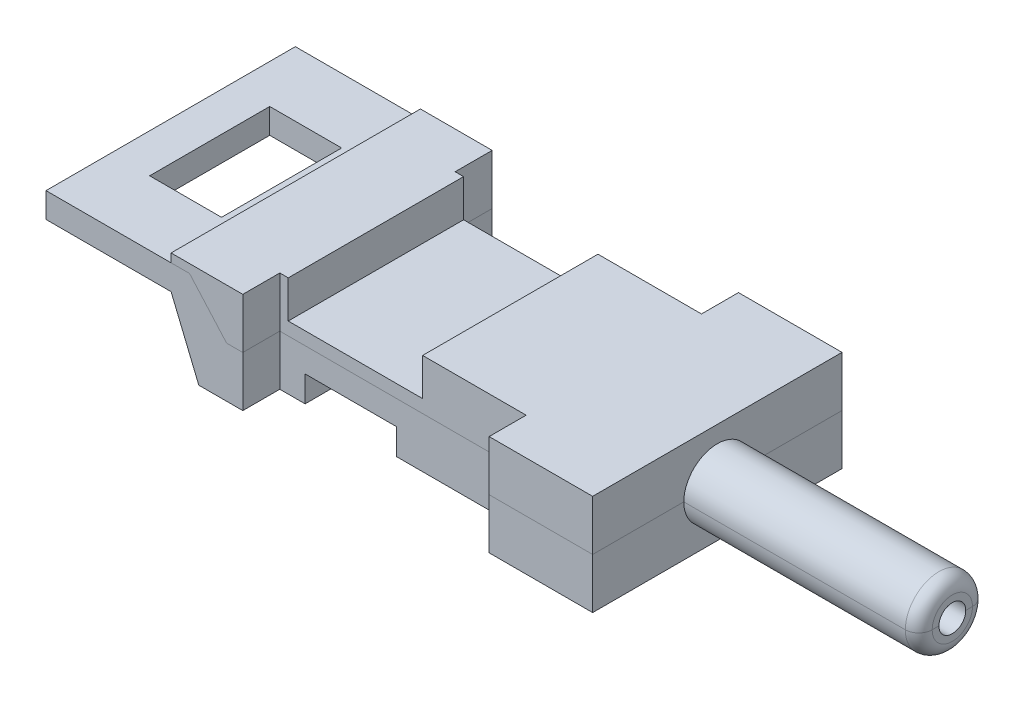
ISO-10303-21;
HEADER;
FILE_DESCRIPTION(('STEP AP214'),'2;1');
FILE_NAME('part.step','',(''),(''),'','','');
FILE_SCHEMA(('AUTOMOTIVE_DESIGN { 1 0 10303 214 1 1 1 1 }'));
ENDSEC;
DATA;
#1=APPLICATION_CONTEXT('core data for automotive mechanical design processes');
#2=APPLICATION_PROTOCOL_DEFINITION('international standard','automotive_design',2000,#1);
#3=PRODUCT_CONTEXT('',#1,'mechanical');
#4=PRODUCT('Part','Part','',(#3));
#5=PRODUCT_RELATED_PRODUCT_CATEGORY('part','',(#4));
#6=PRODUCT_DEFINITION_FORMATION('','',#4);
#7=PRODUCT_DEFINITION_CONTEXT('part definition',#1,'design');
#8=PRODUCT_DEFINITION('design','',#6,#7);
#9=PRODUCT_DEFINITION_SHAPE('','',#8);
#10=(LENGTH_UNIT() NAMED_UNIT(*) SI_UNIT(.MILLI.,.METRE.));
#11=(NAMED_UNIT(*) PLANE_ANGLE_UNIT() SI_UNIT($,.RADIAN.));
#12=(NAMED_UNIT(*) SI_UNIT($,.STERADIAN.) SOLID_ANGLE_UNIT());
#13=UNCERTAINTY_MEASURE_WITH_UNIT(LENGTH_MEASURE(1.E-05),#10,'distance_accuracy_value','');
#14=(GEOMETRIC_REPRESENTATION_CONTEXT(3) GLOBAL_UNCERTAINTY_ASSIGNED_CONTEXT((#13)) GLOBAL_UNIT_ASSIGNED_CONTEXT((#10,
#11,#12)) REPRESENTATION_CONTEXT('',''));
#15=CARTESIAN_POINT('',(0.,0.,0.));
#16=DIRECTION('',(0.,0.,1.));
#17=DIRECTION('',(1.,0.,0.));
#18=AXIS2_PLACEMENT_3D('',#15,#16,#17);
#19=CARTESIAN_POINT('',(25.2903479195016,-10.001,-18.5695273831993));
#20=DIRECTION('',(1.,0.,0.));
#21=DIRECTION('',(0.,0.,-1.));
#22=AXIS2_PLACEMENT_3D('',#19,#20,#21);
#23=PLANE('',#22);
#24=DIRECTION('',(0.,0.,-1.));
#25=VECTOR('',#24,1.);
#26=CARTESIAN_POINT('',(25.2903479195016,-2.5,-18.5695273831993));
#27=LINE('',#26,#25);
#28=CARTESIAN_POINT('',(25.2903479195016,-2.5,-13.0580043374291));
#29=VERTEX_POINT('',#28);
#30=CARTESIAN_POINT('',(25.2903479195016,-2.5,-18.5695273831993));
#31=VERTEX_POINT('',#30);
#32=EDGE_CURVE('E11',#29,#31,#27,.T.);
#33=ORIENTED_EDGE('',*,*,#32,.F.);
#34=DIRECTION('',(0.,1.,0.));
#35=VECTOR('',#34,1.);
#36=CARTESIAN_POINT('',(25.2903479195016,-10.001,-13.0580043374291));
#37=LINE('',#36,#35);
#38=CARTESIAN_POINT('',(25.2903479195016,5.,-13.0580043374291));
#39=VERTEX_POINT('',#38);
#40=EDGE_CURVE('E429',#29,#39,#37,.T.);
#41=ORIENTED_EDGE('',*,*,#40,.T.);
#42=DIRECTION('',(0.,0.,-1.));
#43=VECTOR('',#42,1.);
#44=CARTESIAN_POINT('',(25.2903479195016,5.,-18.5695273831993));
#45=LINE('',#44,#43);
#46=CARTESIAN_POINT('',(25.2903479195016,5.,-18.5695273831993));
#47=VERTEX_POINT('',#46);
#48=EDGE_CURVE('E627',#39,#47,#45,.T.);
#49=ORIENTED_EDGE('',*,*,#48,.T.);
#50=DIRECTION('',(0.,1.,0.));
#51=VECTOR('',#50,1.);
#52=CARTESIAN_POINT('',(25.2903479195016,-10.001,-18.5695273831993));
#53=LINE('',#52,#51);
#54=EDGE_CURVE('E629',#31,#47,#53,.T.);
#55=ORIENTED_EDGE('',*,*,#54,.F.);
#56=EDGE_LOOP('',(#33,#41,#49,#55));
#57=FACE_BOUND('',#56,.T.);
#58=ADVANCED_FACE('F33',(#57),#23,.F.);
#59=CARTESIAN_POINT('',(-11.3977082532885,-10.001,-13.058004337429));
#60=DIRECTION('',(-1.,0.,0.));
#61=DIRECTION('',(0.,0.,1.));
#62=AXIS2_PLACEMENT_3D('',#59,#60,#61);
#63=PLANE('',#62);
#64=DIRECTION('',(0.,0.,1.));
#65=VECTOR('',#64,1.);
#66=CARTESIAN_POINT('',(-11.3977082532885,-2.5,-13.058004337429));
#67=LINE('',#66,#65);
#68=CARTESIAN_POINT('',(-11.3977082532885,-2.5,-18.5695273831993));
#69=VERTEX_POINT('',#68);
#70=CARTESIAN_POINT('',(-11.3977082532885,-2.5,-13.058004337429));
#71=VERTEX_POINT('',#70);
#72=EDGE_CURVE('E43',#69,#71,#67,.T.);
#73=ORIENTED_EDGE('',*,*,#72,.F.);
#74=DIRECTION('',(0.,1.,0.));
#75=VECTOR('',#74,1.);
#76=CARTESIAN_POINT('',(-11.3977082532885,-10.001,-18.5695273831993));
#77=LINE('',#76,#75);
#78=CARTESIAN_POINT('',(-11.3977082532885,5.,-18.5695273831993));
#79=VERTEX_POINT('',#78);
#80=EDGE_CURVE('E446',#69,#79,#77,.T.);
#81=ORIENTED_EDGE('',*,*,#80,.T.);
#82=DIRECTION('',(0.,0.,1.));
#83=VECTOR('',#82,1.);
#84=CARTESIAN_POINT('',(-11.3977082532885,5.,-13.058004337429));
#85=LINE('',#84,#83);
#86=CARTESIAN_POINT('',(-11.3977082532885,5.,-13.058004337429));
#87=VERTEX_POINT('',#86);
#88=EDGE_CURVE('E434',#79,#87,#85,.T.);
#89=ORIENTED_EDGE('',*,*,#88,.T.);
#90=DIRECTION('',(0.,1.,0.));
#91=VECTOR('',#90,1.);
#92=CARTESIAN_POINT('',(-11.3977082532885,-10.001,-13.058004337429));
#93=LINE('',#92,#91);
#94=EDGE_CURVE('E426',#71,#87,#93,.T.);
#95=ORIENTED_EDGE('',*,*,#94,.F.);
#96=EDGE_LOOP('',(#73,#81,#89,#95));
#97=FACE_BOUND('',#96,.T.);
#98=ADVANCED_FACE('F432',(#97),#63,.F.);
#99=CARTESIAN_POINT('',(-40.7086650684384,5.,18.5695273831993));
#100=DIRECTION('',(0.,0.,-1.));
#101=DIRECTION('',(-1.,0.,0.));
#102=AXIS2_PLACEMENT_3D('',#99,#100,#101);
#103=PLANE('',#102);
#104=DIRECTION('',(-1.,0.,0.));
#105=VECTOR('',#104,1.);
#106=CARTESIAN_POINT('',(-40.7086650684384,3.7238100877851,18.5695273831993));
#107=LINE('',#106,#105);
#108=CARTESIAN_POINT('',(-19.3295566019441,3.7238100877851,18.5695273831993));
#109=VERTEX_POINT('',#108);
#110=CARTESIAN_POINT('',(-22.0774506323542,3.7238100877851,18.5695273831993));
#111=VERTEX_POINT('',#110);
#112=EDGE_CURVE('E51',#109,#111,#107,.T.);
#113=ORIENTED_EDGE('',*,*,#112,.F.);
#114=DIRECTION('',(-0.663405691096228,0.748259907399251,0.));
#115=VECTOR('',#114,1.);
#116=CARTESIAN_POINT('',(-29.372154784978,15.0509266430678,18.5695273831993));
#117=LINE('',#116,#115);
#118=CARTESIAN_POINT('',(-13.811539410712,-2.5,18.5695273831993));
#119=VERTEX_POINT('',#118);
#120=EDGE_CURVE('E55',#119,#109,#117,.T.);
#121=ORIENTED_EDGE('',*,*,#120,.F.);
#122=DIRECTION('',(-1.,0.,0.));
#123=VECTOR('',#122,1.);
#124=CARTESIAN_POINT('',(-40.7086650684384,-2.5,18.5695273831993));
#125=LINE('',#124,#123);
#126=CARTESIAN_POINT('',(-11.3977082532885,-2.5,18.5695273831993));
#127=VERTEX_POINT('',#126);
#128=EDGE_CURVE('E369',#127,#119,#125,.T.);
#129=ORIENTED_EDGE('',*,*,#128,.F.);
#130=DIRECTION('',(0.,1.,0.));
#131=VECTOR('',#130,1.);
#132=CARTESIAN_POINT('',(-11.3977082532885,-10.001,18.5695273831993));
#133=LINE('',#132,#131);
#134=CARTESIAN_POINT('',(-11.3977082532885,5.,18.5695273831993));
#135=VERTEX_POINT('',#134);
#136=EDGE_CURVE('E487',#127,#135,#133,.T.);
#137=ORIENTED_EDGE('',*,*,#136,.T.);
#138=DIRECTION('',(1.,0.,0.));
#139=VECTOR('',#138,1.);
#140=CARTESIAN_POINT('',(-40.7086650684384,5.,18.5695273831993));
#141=LINE('',#140,#139);
#142=CARTESIAN_POINT('',(-22.0774506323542,5.,18.5695273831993));
#143=VERTEX_POINT('',#142);
#144=EDGE_CURVE('E581',#143,#135,#141,.T.);
#145=ORIENTED_EDGE('',*,*,#144,.F.);
#146=DIRECTION('',(0.,1.,0.));
#147=VECTOR('',#146,1.);
#148=CARTESIAN_POINT('',(-22.0774506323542,3.7238100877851,18.5695273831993));
#149=LINE('',#148,#147);
#150=EDGE_CURVE('E744',#111,#143,#149,.T.);
#151=ORIENTED_EDGE('',*,*,#150,.F.);
#152=EDGE_LOOP('',(#113,#121,#129,#137,#145,#151));
#153=FACE_BOUND('',#152,.T.);
#154=ADVANCED_FACE('F750',(#153),#103,.F.);
#155=CARTESIAN_POINT('',(-11.3977082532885,-10.001,13.058004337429));
#156=DIRECTION('',(-1.,0.,0.));
#157=DIRECTION('',(0.,0.,1.));
#158=AXIS2_PLACEMENT_3D('',#155,#156,#157);
#159=PLANE('',#158);
#160=DIRECTION('',(0.,0.,1.));
#161=VECTOR('',#160,1.);
#162=CARTESIAN_POINT('',(-11.3977082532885,-2.5,13.058004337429));
#163=LINE('',#162,#161);
#164=CARTESIAN_POINT('',(-11.3977082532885,-2.5,13.058004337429));
#165=VERTEX_POINT('',#164);
#166=EDGE_CURVE('E374',#165,#127,#163,.T.);
#167=ORIENTED_EDGE('',*,*,#166,.F.);
#168=DIRECTION('',(0.,1.,0.));
#169=VECTOR('',#168,1.);
#170=CARTESIAN_POINT('',(-11.3977082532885,-10.001,13.058004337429));
#171=LINE('',#170,#169);
#172=CARTESIAN_POINT('',(-11.3977082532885,5.,13.058004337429));
#173=VERTEX_POINT('',#172);
#174=EDGE_CURVE('E491',#165,#173,#171,.T.);
#175=ORIENTED_EDGE('',*,*,#174,.T.);
#176=DIRECTION('',(0.,0.,1.));
#177=VECTOR('',#176,1.);
#178=CARTESIAN_POINT('',(-11.3977082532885,5.,13.058004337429));
#179=LINE('',#178,#177);
#180=EDGE_CURVE('E479',#173,#135,#179,.T.);
#181=ORIENTED_EDGE('',*,*,#180,.T.);
#182=ORIENTED_EDGE('',*,*,#136,.F.);
#183=EDGE_LOOP('',(#167,#175,#181,#182));
#184=FACE_BOUND('',#183,.T.);
#185=ADVANCED_FACE('F753',(#184),#159,.F.);
#186=CARTESIAN_POINT('',(25.2903479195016,-10.001,13.058004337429));
#187=DIRECTION('',(0.,0.,-1.));
#188=DIRECTION('',(-1.,0.,0.));
#189=AXIS2_PLACEMENT_3D('',#186,#187,#188);
#190=PLANE('',#189);
#191=DIRECTION('',(-1.,0.,0.));
#192=VECTOR('',#191,1.);
#193=CARTESIAN_POINT('',(25.2903479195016,-2.5,13.058004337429));
#194=LINE('',#193,#192);
#195=CARTESIAN_POINT('',(25.2903479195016,-2.5,13.058004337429));
#196=VERTEX_POINT('',#195);
#197=EDGE_CURVE('E378',#196,#165,#194,.T.);
#198=ORIENTED_EDGE('',*,*,#197,.F.);
#199=DIRECTION('',(0.,1.,0.));
#200=VECTOR('',#199,1.);
#201=CARTESIAN_POINT('',(25.2903479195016,-10.001,13.058004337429));
#202=LINE('',#201,#200);
#203=CARTESIAN_POINT('',(25.2903479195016,5.,13.058004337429));
#204=VERTEX_POINT('',#203);
#205=EDGE_CURVE('E495',#196,#204,#202,.T.);
#206=ORIENTED_EDGE('',*,*,#205,.T.);
#207=DIRECTION('',(-1.,0.,0.));
#208=VECTOR('',#207,1.);
#209=CARTESIAN_POINT('',(25.2903479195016,5.,13.058004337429));
#210=LINE('',#209,#208);
#211=CARTESIAN_POINT('',(9.87203077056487,5.,13.058004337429));
#212=VERTEX_POINT('',#211);
#213=EDGE_CURVE('E476',#204,#212,#210,.T.);
#214=ORIENTED_EDGE('',*,*,#213,.T.);
#215=DIRECTION('',(0.,-1.,0.));
#216=VECTOR('',#215,1.);
#217=CARTESIAN_POINT('',(9.87203077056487,-10.001,13.058004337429));
#218=LINE('',#217,#216);
#219=CARTESIAN_POINT('',(9.87203077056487,-0.570466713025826,13.058004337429));
#220=VERTEX_POINT('',#219);
#221=EDGE_CURVE('E463',#212,#220,#218,.T.);
#222=ORIENTED_EDGE('',*,*,#221,.T.);
#223=DIRECTION('',(-1.,0.,0.));
#224=VECTOR('',#223,1.);
#225=CARTESIAN_POINT('',(25.2903479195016,-0.570466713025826,13.058004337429));
#226=LINE('',#225,#224);
#227=CARTESIAN_POINT('',(-10.1412679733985,-0.570466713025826,13.058004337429));
#228=VERTEX_POINT('',#227);
#229=EDGE_CURVE('E512',#220,#228,#226,.T.);
#230=ORIENTED_EDGE('',*,*,#229,.T.);
#231=DIRECTION('',(0.,1.,0.));
#232=VECTOR('',#231,1.);
#233=CARTESIAN_POINT('',(-10.1412679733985,-10.001,13.058004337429));
#234=LINE('',#233,#232);
#235=CARTESIAN_POINT('',(-10.1412679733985,5.,13.058004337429));
#236=VERTEX_POINT('',#235);
#237=EDGE_CURVE('E460',#228,#236,#234,.T.);
#238=ORIENTED_EDGE('',*,*,#237,.T.);
#239=EDGE_CURVE('E475',#236,#173,#210,.T.);
#240=ORIENTED_EDGE('',*,*,#239,.T.);
#241=ORIENTED_EDGE('',*,*,#174,.F.);
#242=EDGE_LOOP('',(#198,#206,#214,#222,#230,#238,#240,#241));
#243=FACE_BOUND('',#242,.T.);
#244=ADVANCED_FACE('F756',(#243),#190,.F.);
#245=DIRECTION('',(-1.,0.,0.));
#246=VECTOR('',#245,1.);
#247=CARTESIAN_POINT('',(-40.7086650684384,-2.5,18.5695273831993));
#248=LINE('',#247,#246);
#249=CARTESIAN_POINT('',(40.7086650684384,-2.5,18.5695273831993));
#250=VERTEX_POINT('',#249);
#251=CARTESIAN_POINT('',(25.2903479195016,-2.5,18.5695273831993));
#252=VERTEX_POINT('',#251);
#253=EDGE_CURVE('E382',#250,#252,#248,.T.);
#254=ORIENTED_EDGE('',*,*,#253,.F.);
#255=DIRECTION('',(0.,-1.,0.));
#256=VECTOR('',#255,1.);
#257=CARTESIAN_POINT('',(40.7086650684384,5.,18.5695273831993));
#258=LINE('',#257,#256);
#259=CARTESIAN_POINT('',(40.7086650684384,5.,18.5695273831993));
#260=VERTEX_POINT('',#259);
#261=EDGE_CURVE('E332',#260,#250,#258,.T.);
#262=ORIENTED_EDGE('',*,*,#261,.F.);
#263=CARTESIAN_POINT('',(25.2903479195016,5.,18.5695273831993));
#264=VERTEX_POINT('',#263);
#265=EDGE_CURVE('E580',#264,#260,#141,.T.);
#266=ORIENTED_EDGE('',*,*,#265,.F.);
#267=DIRECTION('',(0.,1.,0.));
#268=VECTOR('',#267,1.);
#269=CARTESIAN_POINT('',(25.2903479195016,-10.001,18.5695273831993));
#270=LINE('',#269,#268);
#271=EDGE_CURVE('E482',#252,#264,#270,.T.);
#272=ORIENTED_EDGE('',*,*,#271,.F.);
#273=EDGE_LOOP('',(#254,#262,#266,#272));
#274=FACE_BOUND('',#273,.T.);
#275=ADVANCED_FACE('F779',(#274),#103,.F.);
#276=CARTESIAN_POINT('',(40.7086650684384,5.,-18.5695273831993));
#277=DIRECTION('',(-1.,0.,0.));
#278=DIRECTION('',(0.,0.,1.));
#279=AXIS2_PLACEMENT_3D('',#276,#277,#278);
#280=PLANE('',#279);
#281=DIRECTION('',(0.,0.,1.));
#282=VECTOR('',#281,1.);
#283=CARTESIAN_POINT('',(40.7086650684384,-2.5,-18.5695273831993));
#284=LINE('',#283,#282);
#285=CARTESIAN_POINT('',(40.7086650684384,-2.5,-18.5695273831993));
#286=VERTEX_POINT('',#285);
#287=CARTESIAN_POINT('',(40.7086650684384,-2.5,-4.99999999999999));
#288=VERTEX_POINT('',#287);
#289=EDGE_CURVE('E385',#286,#288,#284,.T.);
#290=ORIENTED_EDGE('',*,*,#289,.F.);
#291=DIRECTION('',(0.,-1.,0.));
#292=VECTOR('',#291,1.);
#293=CARTESIAN_POINT('',(40.7086650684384,5.,-18.5695273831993));
#294=LINE('',#293,#292);
#295=CARTESIAN_POINT('',(40.7086650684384,5.,-18.5695273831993));
#296=VERTEX_POINT('',#295);
#297=EDGE_CURVE('E592',#296,#286,#294,.T.);
#298=ORIENTED_EDGE('',*,*,#297,.F.);
#299=DIRECTION('',(0.,0.,-1.));
#300=VECTOR('',#299,1.);
#301=CARTESIAN_POINT('',(40.7086650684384,5.,-18.5695273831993));
#302=LINE('',#301,#300);
#303=EDGE_CURVE('E584',#260,#296,#302,.T.);
#304=ORIENTED_EDGE('',*,*,#303,.F.);
#305=ORIENTED_EDGE('',*,*,#261,.T.);
#306=CARTESIAN_POINT('',(40.7086650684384,-2.5,5.00000000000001));
#307=VERTEX_POINT('',#306);
#308=EDGE_CURVE('E388',#307,#250,#284,.T.);
#309=ORIENTED_EDGE('',*,*,#308,.F.);
#310=CARTESIAN_POINT('',(40.7086650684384,-2.5,0.));
#311=DIRECTION('',(-1.,0.,0.));
#312=DIRECTION('',(0.,0.,1.));
#313=AXIS2_PLACEMENT_3D('',#310,#311,#312);
#314=CIRCLE('',#313,5.);
#315=EDGE_CURVE('E331',#288,#307,#314,.F.);
#316=ORIENTED_EDGE('',*,*,#315,.F.);
#317=EDGE_LOOP('',(#290,#298,#304,#305,#309,#316));
#318=FACE_BOUND('',#317,.T.);
#319=ADVANCED_FACE('F782',(#318),#280,.F.);
#320=CARTESIAN_POINT('',(75.7086650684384,-2.5,0.));
#321=DIRECTION('',(-1.,0.,0.));
#322=DIRECTION('',(0.,0.,1.));
#323=AXIS2_PLACEMENT_3D('',#320,#321,#322);
#324=CYLINDRICAL_SURFACE('',#323,5.);
#325=DIRECTION('',(-1.,0.,0.));
#326=VECTOR('',#325,1.);
#327=CARTESIAN_POINT('',(75.7086650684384,-2.5,5.00000000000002));
#328=LINE('',#327,#326);
#329=CARTESIAN_POINT('',(73.7086650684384,-2.5,5.00000000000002));
#330=VERTEX_POINT('',#329);
#331=EDGE_CURVE('E389',#330,#307,#328,.T.);
#332=ORIENTED_EDGE('',*,*,#331,.F.);
#333=CARTESIAN_POINT('',(73.7086650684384,-2.5,0.));
#334=DIRECTION('',(1.,0.,0.));
#335=DIRECTION('',(0.,0.,-1.));
#336=AXIS2_PLACEMENT_3D('',#333,#334,#335);
#337=CIRCLE('',#336,5.);
#338=CARTESIAN_POINT('',(73.7086650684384,-2.5,-4.99999999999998));
#339=VERTEX_POINT('',#338);
#340=EDGE_CURVE('E347',#330,#339,#337,.F.);
#341=ORIENTED_EDGE('',*,*,#340,.T.);
#342=DIRECTION('',(-1.,0.,0.));
#343=VECTOR('',#342,1.);
#344=CARTESIAN_POINT('',(75.7086650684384,-2.5,-4.99999999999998));
#345=LINE('',#344,#343);
#346=EDGE_CURVE('E393',#288,#339,#345,.F.);
#347=ORIENTED_EDGE('',*,*,#346,.F.);
#348=ORIENTED_EDGE('',*,*,#315,.T.);
#349=EDGE_LOOP('',(#332,#341,#347,#348));
#350=FACE_BOUND('',#349,.T.);
#351=ADVANCED_FACE('F875',(#350),#324,.T.);
#352=CARTESIAN_POINT('',(73.7086650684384,-2.5,0.));
#353=DIRECTION('',(1.,0.,0.));
#354=DIRECTION('',(0.,0.,-1.));
#355=AXIS2_PLACEMENT_3D('',#352,#353,#354);
#356=TOROIDAL_SURFACE('',#355,3.,2.);
#357=CARTESIAN_POINT('',(75.7086650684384,-2.5,0.));
#358=DIRECTION('',(1.,0.,0.));
#359=DIRECTION('',(0.,0.,-1.));
#360=AXIS2_PLACEMENT_3D('',#357,#358,#359);
#361=CIRCLE('',#360,3.);
#362=CARTESIAN_POINT('',(75.7086650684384,-2.5,-2.99999999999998));
#363=VERTEX_POINT('',#362);
#364=CARTESIAN_POINT('',(75.7086650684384,-2.5,3.00000000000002));
#365=VERTEX_POINT('',#364);
#366=EDGE_CURVE('E344',#363,#365,#361,.T.);
#367=ORIENTED_EDGE('',*,*,#366,.F.);
#368=CARTESIAN_POINT('',(73.7086650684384,-2.5,-2.99999999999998));
#369=DIRECTION('',(0.,-1.,0.));
#370=DIRECTION('',(0.,0.,-1.));
#371=AXIS2_PLACEMENT_3D('',#368,#369,#370);
#372=CIRCLE('',#371,2.);
#373=EDGE_CURVE('E397',#363,#339,#372,.F.);
#374=ORIENTED_EDGE('',*,*,#373,.T.);
#375=ORIENTED_EDGE('',*,*,#340,.F.);
#376=CARTESIAN_POINT('',(73.7086650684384,-2.5,3.00000000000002));
#377=DIRECTION('',(0.,-1.,0.));
#378=DIRECTION('',(0.,0.,-1.));
#379=AXIS2_PLACEMENT_3D('',#376,#377,#378);
#380=CIRCLE('',#379,2.);
#381=EDGE_CURVE('E394',#330,#365,#380,.F.);
#382=ORIENTED_EDGE('',*,*,#381,.T.);
#383=EDGE_LOOP('',(#367,#374,#375,#382));
#384=FACE_BOUND('',#383,.T.);
#385=ADVANCED_FACE('F792',(#384),#356,.T.);
#386=CARTESIAN_POINT('',(75.7086650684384,-2.5,0.));
#387=DIRECTION('',(1.,0.,0.));
#388=DIRECTION('',(0.,0.,-1.));
#389=AXIS2_PLACEMENT_3D('',#386,#387,#388);
#390=PLANE('',#389);
#391=ORIENTED_EDGE('',*,*,#366,.T.);
#392=DIRECTION('',(0.,0.,-1.));
#393=VECTOR('',#392,1.);
#394=CARTESIAN_POINT('',(75.7086650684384,-2.5,0.));
#395=LINE('',#394,#393);
#396=CARTESIAN_POINT('',(75.7086650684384,-2.5,2.00000000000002));
#397=VERTEX_POINT('',#396);
#398=EDGE_CURVE('E358',#365,#397,#395,.T.);
#399=ORIENTED_EDGE('',*,*,#398,.T.);
#400=CARTESIAN_POINT('',(75.7086650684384,-2.5,0.));
#401=DIRECTION('',(1.,0.,0.));
#402=DIRECTION('',(0.,0.,-1.));
#403=AXIS2_PLACEMENT_3D('',#400,#401,#402);
#404=CIRCLE('',#403,2.);
#405=CARTESIAN_POINT('',(75.7086650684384,-2.5,-1.99999999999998));
#406=VERTEX_POINT('',#405);
#407=EDGE_CURVE('E726',#406,#397,#404,.T.);
#408=ORIENTED_EDGE('',*,*,#407,.F.);
#409=EDGE_CURVE('E354',#406,#363,#395,.T.);
#410=ORIENTED_EDGE('',*,*,#409,.T.);
#411=EDGE_LOOP('',(#391,#399,#408,#410));
#412=FACE_BOUND('',#411,.T.);
#413=ADVANCED_FACE('F785',(#412),#390,.T.);
#414=CARTESIAN_POINT('',(-40.7086650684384,5.,-18.5695273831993));
#415=DIRECTION('',(0.,0.,1.));
#416=DIRECTION('',(1.,0.,0.));
#417=AXIS2_PLACEMENT_3D('',#414,#415,#416);
#418=PLANE('',#417);
#419=DIRECTION('',(1.,0.,0.));
#420=VECTOR('',#419,1.);
#421=CARTESIAN_POINT('',(-40.7086650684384,-2.5,-18.5695273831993));
#422=LINE('',#421,#420);
#423=EDGE_CURVE('E359',#31,#286,#422,.T.);
#424=ORIENTED_EDGE('',*,*,#423,.F.);
#425=ORIENTED_EDGE('',*,*,#54,.T.);
#426=DIRECTION('',(-1.,0.,0.));
#427=VECTOR('',#426,1.);
#428=CARTESIAN_POINT('',(-40.7086650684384,5.,-18.5695273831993));
#429=LINE('',#428,#427);
#430=EDGE_CURVE('E587',#296,#47,#429,.T.);
#431=ORIENTED_EDGE('',*,*,#430,.F.);
#432=ORIENTED_EDGE('',*,*,#297,.T.);
#433=EDGE_LOOP('',(#424,#425,#431,#432));
#434=FACE_BOUND('',#433,.T.);
#435=ADVANCED_FACE('F783',(#434),#418,.F.);
#436=CARTESIAN_POINT('',(25.2903479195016,-10.001,-13.0580043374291));
#437=DIRECTION('',(0.,0.,1.));
#438=DIRECTION('',(1.,0.,0.));
#439=AXIS2_PLACEMENT_3D('',#436,#437,#438);
#440=PLANE('',#439);
#441=DIRECTION('',(1.,0.,0.));
#442=VECTOR('',#441,1.);
#443=CARTESIAN_POINT('',(25.2903479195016,-2.5,-13.0580043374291));
#444=LINE('',#443,#442);
#445=EDGE_CURVE('E365',#71,#29,#444,.T.);
#446=ORIENTED_EDGE('',*,*,#445,.F.);
#447=ORIENTED_EDGE('',*,*,#94,.T.);
#448=DIRECTION('',(1.,0.,0.));
#449=VECTOR('',#448,1.);
#450=CARTESIAN_POINT('',(25.2903479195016,5.,-13.0580043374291));
#451=LINE('',#450,#449);
#452=CARTESIAN_POINT('',(-10.1412679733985,5.,-13.058004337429));
#453=VERTEX_POINT('',#452);
#454=EDGE_CURVE('E625',#87,#453,#451,.T.);
#455=ORIENTED_EDGE('',*,*,#454,.T.);
#456=DIRECTION('',(0.,-1.,0.));
#457=VECTOR('',#456,1.);
#458=CARTESIAN_POINT('',(-10.1412679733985,-10.001,-13.058004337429));
#459=LINE('',#458,#457);
#460=CARTESIAN_POINT('',(-10.1412679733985,-0.570466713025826,-13.058004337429));
#461=VERTEX_POINT('',#460);
#462=EDGE_CURVE('E683',#453,#461,#459,.T.);
#463=ORIENTED_EDGE('',*,*,#462,.T.);
#464=DIRECTION('',(1.,0.,0.));
#465=VECTOR('',#464,1.);
#466=CARTESIAN_POINT('',(25.2903479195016,-0.570466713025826,-13.0580043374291));
#467=LINE('',#466,#465);
#468=CARTESIAN_POINT('',(9.87203077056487,-0.570466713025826,-13.0580043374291));
#469=VERTEX_POINT('',#468);
#470=EDGE_CURVE('E458',#461,#469,#467,.T.);
#471=ORIENTED_EDGE('',*,*,#470,.T.);
#472=DIRECTION('',(0.,1.,0.));
#473=VECTOR('',#472,1.);
#474=CARTESIAN_POINT('',(9.87203077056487,-10.001,-13.0580043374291));
#475=LINE('',#474,#473);
#476=CARTESIAN_POINT('',(9.87203077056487,5.,-13.0580043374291));
#477=VERTEX_POINT('',#476);
#478=EDGE_CURVE('E621',#469,#477,#475,.T.);
#479=ORIENTED_EDGE('',*,*,#478,.T.);
#480=EDGE_CURVE('E619',#477,#39,#451,.T.);
#481=ORIENTED_EDGE('',*,*,#480,.T.);
#482=ORIENTED_EDGE('',*,*,#40,.F.);
#483=EDGE_LOOP('',(#446,#447,#455,#463,#471,#479,#481,#482));
#484=FACE_BOUND('',#483,.T.);
#485=ADVANCED_FACE('F425',(#484),#440,.F.);
#486=DIRECTION('',(1.,0.,0.));
#487=VECTOR('',#486,1.);
#488=CARTESIAN_POINT('',(-40.7086650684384,3.7238100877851,-18.5695273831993));
#489=LINE('',#488,#487);
#490=CARTESIAN_POINT('',(-22.0774506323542,3.7238100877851,-18.5695273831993));
#491=VERTEX_POINT('',#490);
#492=CARTESIAN_POINT('',(-19.3295566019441,3.7238100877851,-18.5695273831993));
#493=VERTEX_POINT('',#492);
#494=EDGE_CURVE('E362',#491,#493,#489,.T.);
#495=ORIENTED_EDGE('',*,*,#494,.F.);
#496=DIRECTION('',(0.,-1.,0.));
#497=VECTOR('',#496,1.);
#498=CARTESIAN_POINT('',(-22.0774506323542,5.00000000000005,-18.5695273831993));
#499=LINE('',#498,#497);
#500=CARTESIAN_POINT('',(-22.0774506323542,5.,-18.5695273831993));
#501=VERTEX_POINT('',#500);
#502=EDGE_CURVE('E730',#501,#491,#499,.T.);
#503=ORIENTED_EDGE('',*,*,#502,.F.);
#504=EDGE_CURVE('E586',#79,#501,#429,.T.);
#505=ORIENTED_EDGE('',*,*,#504,.F.);
#506=ORIENTED_EDGE('',*,*,#80,.F.);
#507=DIRECTION('',(1.,0.,0.));
#508=VECTOR('',#507,1.);
#509=CARTESIAN_POINT('',(-40.7086650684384,-2.5,-18.5695273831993));
#510=LINE('',#509,#508);
#511=CARTESIAN_POINT('',(-13.811539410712,-2.5,-18.5695273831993));
#512=VERTEX_POINT('',#511);
#513=EDGE_CURVE('E37',#512,#69,#510,.T.);
#514=ORIENTED_EDGE('',*,*,#513,.F.);
#515=DIRECTION('',(0.663405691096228,-0.748259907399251,0.));
#516=VECTOR('',#515,1.);
#517=CARTESIAN_POINT('',(-29.372154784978,15.0509266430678,-18.5695273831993));
#518=LINE('',#517,#516);
#519=EDGE_CURVE('E366',#493,#512,#518,.T.);
#520=ORIENTED_EDGE('',*,*,#519,.F.);
#521=EDGE_LOOP('',(#495,#503,#505,#506,#514,#520));
#522=FACE_BOUND('',#521,.T.);
#523=ADVANCED_FACE('F674',(#522),#418,.F.);
#524=ORIENTED_EDGE('',*,*,#120,.T.);
#525=ORIENTED_EDGE('',*,*,#112,.T.);
#526=DIRECTION('',(1.,0.,0.));
#527=VECTOR('',#526,1.);
#528=CARTESIAN_POINT('',(-40.7086650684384,3.7238100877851,18.5695273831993));
#529=LINE('',#528,#527);
#530=CARTESIAN_POINT('',(-40.7086650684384,3.7238100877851,18.5695273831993));
#531=VERTEX_POINT('',#530);
#532=EDGE_CURVE('E312',#531,#111,#529,.T.);
#533=ORIENTED_EDGE('',*,*,#532,.F.);
#534=DIRECTION('',(0.,-1.,0.));
#535=VECTOR('',#534,1.);
#536=CARTESIAN_POINT('',(-40.7086650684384,5.,18.5695273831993));
#537=LINE('',#536,#535);
#538=CARTESIAN_POINT('',(-40.7086650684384,0.,18.5695273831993));
#539=VERTEX_POINT('',#538);
#540=EDGE_CURVE('E323',#531,#539,#537,.T.);
#541=ORIENTED_EDGE('',*,*,#540,.T.);
#542=DIRECTION('',(-1.,0.,0.));
#543=VECTOR('',#542,1.);
#544=CARTESIAN_POINT('',(-40.7086650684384,0.,18.5695273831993));
#545=LINE('',#544,#543);
#546=CARTESIAN_POINT('',(-22.0774506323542,0.,18.5695273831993));
#547=VERTEX_POINT('',#546);
#548=EDGE_CURVE('E556',#547,#539,#545,.T.);
#549=ORIENTED_EDGE('',*,*,#548,.F.);
#550=DIRECTION('',(-0.381591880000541,0.924330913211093,0.));
#551=VECTOR('',#550,1.);
#552=CARTESIAN_POINT('',(-22.0774506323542,0.,18.5695273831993));
#553=LINE('',#552,#551);
#554=CARTESIAN_POINT('',(-17.9491468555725,-10.,18.5695273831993));
#555=VERTEX_POINT('',#554);
#556=EDGE_CURVE('E548',#555,#547,#553,.T.);
#557=ORIENTED_EDGE('',*,*,#556,.F.);
#558=DIRECTION('',(1.,0.,0.));
#559=VECTOR('',#558,1.);
#560=CARTESIAN_POINT('',(-40.7086650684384,-10.,18.5695273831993));
#561=LINE('',#560,#559);
#562=CARTESIAN_POINT('',(-11.3977082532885,-10.,18.5695273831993));
#563=VERTEX_POINT('',#562);
#564=EDGE_CURVE('E570',#555,#563,#561,.T.);
#565=ORIENTED_EDGE('',*,*,#564,.T.);
#566=EDGE_CURVE('E483',#563,#127,#133,.T.);
#567=ORIENTED_EDGE('',*,*,#566,.T.);
#568=ORIENTED_EDGE('',*,*,#128,.T.);
#569=EDGE_LOOP('',(#524,#525,#533,#541,#549,#557,#565,#567,#568));
#570=FACE_BOUND('',#569,.T.);
#571=ADVANCED_FACE('F321',(#570),#103,.F.);
#572=CARTESIAN_POINT('',(-40.7086650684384,5.,-18.5695273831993));
#573=DIRECTION('',(1.,0.,0.));
#574=DIRECTION('',(0.,0.,-1.));
#575=AXIS2_PLACEMENT_3D('',#572,#573,#574);
#576=PLANE('',#575);
#577=DIRECTION('',(0.,0.,-1.));
#578=VECTOR('',#577,1.);
#579=CARTESIAN_POINT('',(-40.7086650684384,3.7238100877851,18.5695273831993));
#580=LINE('',#579,#578);
#581=CARTESIAN_POINT('',(-40.7086650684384,3.7238100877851,-18.5695273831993));
#582=VERTEX_POINT('',#581);
#583=EDGE_CURVE('E308',#531,#582,#580,.T.);
#584=ORIENTED_EDGE('',*,*,#583,.T.);
#585=DIRECTION('',(0.,-1.,0.));
#586=VECTOR('',#585,1.);
#587=CARTESIAN_POINT('',(-40.7086650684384,5.,-18.5695273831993));
#588=LINE('',#587,#586);
#589=CARTESIAN_POINT('',(-40.7086650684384,0.,-18.5695273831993));
#590=VERTEX_POINT('',#589);
#591=EDGE_CURVE('E590',#582,#590,#588,.T.);
#592=ORIENTED_EDGE('',*,*,#591,.T.);
#593=DIRECTION('',(0.,0.,1.));
#594=VECTOR('',#593,1.);
#595=CARTESIAN_POINT('',(-40.7086650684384,0.,-18.5695273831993));
#596=LINE('',#595,#594);
#597=EDGE_CURVE('E330',#590,#539,#596,.T.);
#598=ORIENTED_EDGE('',*,*,#597,.T.);
#599=ORIENTED_EDGE('',*,*,#540,.F.);
#600=EDGE_LOOP('',(#584,#592,#598,#599));
#601=FACE_BOUND('',#600,.T.);
#602=ADVANCED_FACE('F35',(#601),#576,.F.);
#603=DIRECTION('',(-1.,0.,0.));
#604=VECTOR('',#603,1.);
#605=CARTESIAN_POINT('',(-40.7086650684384,3.7238100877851,-18.5695273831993));
#606=LINE('',#605,#604);
#607=EDGE_CURVE('E314',#491,#582,#606,.T.);
#608=ORIENTED_EDGE('',*,*,#607,.F.);
#609=ORIENTED_EDGE('',*,*,#494,.T.);
#610=ORIENTED_EDGE('',*,*,#519,.T.);
#611=ORIENTED_EDGE('',*,*,#513,.T.);
#612=CARTESIAN_POINT('',(-11.3977082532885,-10.,-18.5695273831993));
#613=VERTEX_POINT('',#612);
#614=EDGE_CURVE('E419',#613,#69,#77,.T.);
#615=ORIENTED_EDGE('',*,*,#614,.F.);
#616=DIRECTION('',(-1.,0.,0.));
#617=VECTOR('',#616,1.);
#618=CARTESIAN_POINT('',(-40.7086650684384,-10.,-18.5695273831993));
#619=LINE('',#618,#617);
#620=CARTESIAN_POINT('',(-17.9491468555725,-10.,-18.5695273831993));
#621=VERTEX_POINT('',#620);
#622=EDGE_CURVE('E576',#613,#621,#619,.T.);
#623=ORIENTED_EDGE('',*,*,#622,.T.);
#624=DIRECTION('',(-0.381591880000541,0.924330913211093,0.));
#625=VECTOR('',#624,1.);
#626=CARTESIAN_POINT('',(-22.0774506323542,0.,-18.5695273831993));
#627=LINE('',#626,#625);
#628=CARTESIAN_POINT('',(-22.0774506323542,0.,-18.5695273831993));
#629=VERTEX_POINT('',#628);
#630=EDGE_CURVE('E558',#621,#629,#627,.T.);
#631=ORIENTED_EDGE('',*,*,#630,.T.);
#632=DIRECTION('',(-1.,0.,0.));
#633=VECTOR('',#632,1.);
#634=CARTESIAN_POINT('',(-40.7086650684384,0.,-18.5695273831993));
#635=LINE('',#634,#633);
#636=EDGE_CURVE('E561',#629,#590,#635,.T.);
#637=ORIENTED_EDGE('',*,*,#636,.T.);
#638=ORIENTED_EDGE('',*,*,#591,.F.);
#639=EDGE_LOOP('',(#608,#609,#610,#611,#615,#623,#631,#637,#638));
#640=FACE_BOUND('',#639,.T.);
#641=ADVANCED_FACE('F667',(#640),#418,.F.);
#642=CARTESIAN_POINT('',(-40.7086650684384,5.,18.5695273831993));
#643=DIRECTION('',(0.,1.,0.));
#644=DIRECTION('',(0.,0.,1.));
#645=AXIS2_PLACEMENT_3D('',#642,#643,#644);
#646=PLANE('',#645);
#647=ORIENTED_EDGE('',*,*,#504,.T.);
#648=DIRECTION('',(0.,0.,-1.));
#649=VECTOR('',#648,1.);
#650=CARTESIAN_POINT('',(-22.0774506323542,5.,18.5695273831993));
#651=LINE('',#650,#649);
#652=EDGE_CURVE('E318',#143,#501,#651,.T.);
#653=ORIENTED_EDGE('',*,*,#652,.F.);
#654=ORIENTED_EDGE('',*,*,#144,.T.);
#655=ORIENTED_EDGE('',*,*,#180,.F.);
#656=ORIENTED_EDGE('',*,*,#239,.F.);
#657=DIRECTION('',(0.,0.,1.));
#658=VECTOR('',#657,1.);
#659=CARTESIAN_POINT('',(-10.1412679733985,5.,-18.5695273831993));
#660=LINE('',#659,#658);
#661=EDGE_CURVE('E540',#453,#236,#660,.T.);
#662=ORIENTED_EDGE('',*,*,#661,.F.);
#663=ORIENTED_EDGE('',*,*,#454,.F.);
#664=ORIENTED_EDGE('',*,*,#88,.F.);
#665=EDGE_LOOP('',(#647,#653,#654,#655,#656,#662,#663,#664));
#666=FACE_BOUND('',#665,.T.);
#667=ADVANCED_FACE('F678',(#666),#646,.T.);
#668=CARTESIAN_POINT('',(-34.9005323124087,-10.001,-8.94289846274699));
#669=DIRECTION('',(-1.,0.,0.));
#670=DIRECTION('',(0.,0.,1.));
#671=AXIS2_PLACEMENT_3D('',#668,#669,#670);
#672=PLANE('',#671);
#673=DIRECTION('',(0.,0.,-1.));
#674=VECTOR('',#673,1.);
#675=CARTESIAN_POINT('',(-34.9005323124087,3.7238100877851,-8.94289846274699));
#676=LINE('',#675,#674);
#677=CARTESIAN_POINT('',(-34.9005323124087,3.7238100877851,8.94289846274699));
#678=VERTEX_POINT('',#677);
#679=CARTESIAN_POINT('',(-34.9005323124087,3.7238100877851,-8.94289846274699));
#680=VERTEX_POINT('',#679);
#681=EDGE_CURVE('E734',#678,#680,#676,.T.);
#682=ORIENTED_EDGE('',*,*,#681,.F.);
#683=DIRECTION('',(0.,1.,0.));
#684=VECTOR('',#683,1.);
#685=CARTESIAN_POINT('',(-34.9005323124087,-10.001,8.94289846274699));
#686=LINE('',#685,#684);
#687=CARTESIAN_POINT('',(-34.9005323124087,0.,8.94289846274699));
#688=VERTEX_POINT('',#687);
#689=EDGE_CURVE('E523',#688,#678,#686,.T.);
#690=ORIENTED_EDGE('',*,*,#689,.F.);
#691=DIRECTION('',(0.,0.,-1.));
#692=VECTOR('',#691,1.);
#693=CARTESIAN_POINT('',(-34.9005323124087,0.,-8.94289846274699));
#694=LINE('',#693,#692);
#695=CARTESIAN_POINT('',(-34.9005323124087,0.,-8.94289846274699));
#696=VERTEX_POINT('',#695);
#697=EDGE_CURVE('E520',#688,#696,#694,.T.);
#698=ORIENTED_EDGE('',*,*,#697,.T.);
#699=DIRECTION('',(0.,1.,0.));
#700=VECTOR('',#699,1.);
#701=CARTESIAN_POINT('',(-34.9005323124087,-10.001,-8.94289846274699));
#702=LINE('',#701,#700);
#703=EDGE_CURVE('E524',#696,#680,#702,.T.);
#704=ORIENTED_EDGE('',*,*,#703,.T.);
#705=EDGE_LOOP('',(#682,#690,#698,#704));
#706=FACE_BOUND('',#705,.T.);
#707=ADVANCED_FACE('F824',(#706),#672,.F.);
#708=CARTESIAN_POINT('',(-34.9005323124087,-10.001,-8.94289846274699));
#709=DIRECTION('',(0.,0.,-1.));
#710=DIRECTION('',(-1.,0.,0.));
#711=AXIS2_PLACEMENT_3D('',#708,#709,#710);
#712=PLANE('',#711);
#713=DIRECTION('',(1.,0.,0.));
#714=VECTOR('',#713,1.);
#715=CARTESIAN_POINT('',(-34.9005323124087,3.7238100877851,-8.94289846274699));
#716=LINE('',#715,#714);
#717=CARTESIAN_POINT('',(-24.1925625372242,3.7238100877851,-8.94289846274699));
#718=VERTEX_POINT('',#717);
#719=EDGE_CURVE('E737',#680,#718,#716,.T.);
#720=ORIENTED_EDGE('',*,*,#719,.F.);
#721=ORIENTED_EDGE('',*,*,#703,.F.);
#722=DIRECTION('',(1.,0.,0.));
#723=VECTOR('',#722,1.);
#724=CARTESIAN_POINT('',(-34.9005323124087,0.,-8.94289846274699));
#725=LINE('',#724,#723);
#726=CARTESIAN_POINT('',(-24.1925625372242,0.,-8.94289846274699));
#727=VERTEX_POINT('',#726);
#728=EDGE_CURVE('E517',#696,#727,#725,.T.);
#729=ORIENTED_EDGE('',*,*,#728,.T.);
#730=DIRECTION('',(0.,1.,0.));
#731=VECTOR('',#730,1.);
#732=CARTESIAN_POINT('',(-24.1925625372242,-10.001,-8.94289846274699));
#733=LINE('',#732,#731);
#734=EDGE_CURVE('E528',#727,#718,#733,.T.);
#735=ORIENTED_EDGE('',*,*,#734,.T.);
#736=EDGE_LOOP('',(#720,#721,#729,#735));
#737=FACE_BOUND('',#736,.T.);
#738=ADVANCED_FACE('F820',(#737),#712,.F.);
#739=CARTESIAN_POINT('',(-24.1925625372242,-10.001,-8.94289846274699));
#740=DIRECTION('',(1.,0.,0.));
#741=DIRECTION('',(0.,0.,-1.));
#742=AXIS2_PLACEMENT_3D('',#739,#740,#741);
#743=PLANE('',#742);
#744=DIRECTION('',(0.,0.,1.));
#745=VECTOR('',#744,1.);
#746=CARTESIAN_POINT('',(-24.1925625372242,3.7238100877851,-8.94289846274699));
#747=LINE('',#746,#745);
#748=CARTESIAN_POINT('',(-24.1925625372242,3.7238100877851,8.94289846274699));
#749=VERTEX_POINT('',#748);
#750=EDGE_CURVE('E326',#718,#749,#747,.T.);
#751=ORIENTED_EDGE('',*,*,#750,.F.);
#752=ORIENTED_EDGE('',*,*,#734,.F.);
#753=DIRECTION('',(0.,0.,1.));
#754=VECTOR('',#753,1.);
#755=CARTESIAN_POINT('',(-24.1925625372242,0.,-8.94289846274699));
#756=LINE('',#755,#754);
#757=CARTESIAN_POINT('',(-24.1925625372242,0.,8.94289846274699));
#758=VERTEX_POINT('',#757);
#759=EDGE_CURVE('E515',#727,#758,#756,.T.);
#760=ORIENTED_EDGE('',*,*,#759,.T.);
#761=DIRECTION('',(0.,1.,0.));
#762=VECTOR('',#761,1.);
#763=CARTESIAN_POINT('',(-24.1925625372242,-10.001,8.94289846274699));
#764=LINE('',#763,#762);
#765=EDGE_CURVE('E531',#758,#749,#764,.T.);
#766=ORIENTED_EDGE('',*,*,#765,.T.);
#767=EDGE_LOOP('',(#751,#752,#760,#766));
#768=FACE_BOUND('',#767,.T.);
#769=ADVANCED_FACE('F823',(#768),#743,.F.);
#770=CARTESIAN_POINT('',(-34.9005323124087,-10.001,8.94289846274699));
#771=DIRECTION('',(0.,0.,1.));
#772=DIRECTION('',(1.,0.,0.));
#773=AXIS2_PLACEMENT_3D('',#770,#771,#772);
#774=PLANE('',#773);
#775=DIRECTION('',(-1.,0.,0.));
#776=VECTOR('',#775,1.);
#777=CARTESIAN_POINT('',(-34.9005323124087,3.7238100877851,8.94289846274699));
#778=LINE('',#777,#776);
#779=EDGE_CURVE('E351',#749,#678,#778,.T.);
#780=ORIENTED_EDGE('',*,*,#779,.F.);
#781=ORIENTED_EDGE('',*,*,#765,.F.);
#782=DIRECTION('',(-1.,0.,0.));
#783=VECTOR('',#782,1.);
#784=CARTESIAN_POINT('',(-34.9005323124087,0.,8.94289846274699));
#785=LINE('',#784,#783);
#786=EDGE_CURVE('E527',#758,#688,#785,.T.);
#787=ORIENTED_EDGE('',*,*,#786,.T.);
#788=ORIENTED_EDGE('',*,*,#689,.T.);
#789=EDGE_LOOP('',(#780,#781,#787,#788));
#790=FACE_BOUND('',#789,.T.);
#791=ADVANCED_FACE('F828',(#790),#774,.F.);
#792=CARTESIAN_POINT('',(40.7086650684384,-10.,-18.5695273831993));
#793=VERTEX_POINT('',#792);
#794=EDGE_CURVE('E591',#286,#793,#294,.T.);
#795=ORIENTED_EDGE('',*,*,#794,.F.);
#796=ORIENTED_EDGE('',*,*,#289,.T.);
#797=EDGE_CURVE('E335',#307,#288,#314,.F.);
#798=ORIENTED_EDGE('',*,*,#797,.F.);
#799=ORIENTED_EDGE('',*,*,#308,.T.);
#800=CARTESIAN_POINT('',(40.7086650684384,-10.,18.5695273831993));
#801=VERTEX_POINT('',#800);
#802=EDGE_CURVE('E338',#250,#801,#258,.T.);
#803=ORIENTED_EDGE('',*,*,#802,.T.);
#804=DIRECTION('',(0.,0.,-1.));
#805=VECTOR('',#804,1.);
#806=CARTESIAN_POINT('',(40.7086650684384,-10.,-18.5695273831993));
#807=LINE('',#806,#805);
#808=EDGE_CURVE('E573',#801,#793,#807,.T.);
#809=ORIENTED_EDGE('',*,*,#808,.T.);
#810=EDGE_LOOP('',(#795,#796,#798,#799,#803,#809));
#811=FACE_BOUND('',#810,.T.);
#812=ADVANCED_FACE('F605',(#811),#280,.F.);
#813=CARTESIAN_POINT('',(25.2903479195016,-10.,-18.5695273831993));
#814=VERTEX_POINT('',#813);
#815=EDGE_CURVE('E450',#814,#31,#53,.T.);
#816=ORIENTED_EDGE('',*,*,#815,.T.);
#817=ORIENTED_EDGE('',*,*,#423,.T.);
#818=ORIENTED_EDGE('',*,*,#794,.T.);
#819=EDGE_CURVE('E577',#793,#814,#619,.T.);
#820=ORIENTED_EDGE('',*,*,#819,.T.);
#821=EDGE_LOOP('',(#816,#817,#818,#820));
#822=FACE_BOUND('',#821,.T.);
#823=ADVANCED_FACE('F601',(#822),#418,.F.);
#824=CARTESIAN_POINT('',(-40.7086650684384,-10.,18.5695273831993));
#825=DIRECTION('',(0.,1.,0.));
#826=DIRECTION('',(0.,0.,1.));
#827=AXIS2_PLACEMENT_3D('',#824,#825,#826);
#828=PLANE('',#827);
#829=DIRECTION('',(0.,0.,-1.));
#830=VECTOR('',#829,1.);
#831=CARTESIAN_POINT('',(-11.3977082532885,-10.,-13.058004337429));
#832=LINE('',#831,#830);
#833=CARTESIAN_POINT('',(-11.3977082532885,-10.,-13.058004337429));
#834=VERTEX_POINT('',#833);
#835=EDGE_CURVE('E447',#834,#613,#832,.T.);
#836=ORIENTED_EDGE('',*,*,#835,.F.);
#837=DIRECTION('',(-1.,0.,0.));
#838=VECTOR('',#837,1.);
#839=CARTESIAN_POINT('',(25.2903479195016,-10.,-13.0580043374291));
#840=LINE('',#839,#838);
#841=CARTESIAN_POINT('',(-7.62838741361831,-10.,-13.058004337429));
#842=VERTEX_POINT('',#841);
#843=EDGE_CURVE('E439',#842,#834,#840,.T.);
#844=ORIENTED_EDGE('',*,*,#843,.F.);
#845=DIRECTION('',(0.,0.,1.));
#846=VECTOR('',#845,1.);
#847=CARTESIAN_POINT('',(-7.62838741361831,-10.,-18.5695273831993));
#848=LINE('',#847,#846);
#849=CARTESIAN_POINT('',(-7.62838741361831,-10.,13.058004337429));
#850=VERTEX_POINT('',#849);
#851=EDGE_CURVE('E538',#842,#850,#848,.T.);
#852=ORIENTED_EDGE('',*,*,#851,.T.);
#853=DIRECTION('',(1.,0.,0.));
#854=VECTOR('',#853,1.);
#855=CARTESIAN_POINT('',(25.2903479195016,-10.,13.058004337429));
#856=LINE('',#855,#854);
#857=CARTESIAN_POINT('',(-11.3977082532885,-10.,13.058004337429));
#858=VERTEX_POINT('',#857);
#859=EDGE_CURVE('E509',#858,#850,#856,.T.);
#860=ORIENTED_EDGE('',*,*,#859,.F.);
#861=DIRECTION('',(0.,0.,-1.));
#862=VECTOR('',#861,1.);
#863=CARTESIAN_POINT('',(-11.3977082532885,-10.,13.058004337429));
#864=LINE('',#863,#862);
#865=EDGE_CURVE('E469',#563,#858,#864,.T.);
#866=ORIENTED_EDGE('',*,*,#865,.F.);
#867=ORIENTED_EDGE('',*,*,#564,.F.);
#868=DIRECTION('',(0.,0.,1.));
#869=VECTOR('',#868,1.);
#870=CARTESIAN_POINT('',(-17.9491468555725,-10.,-18.5695273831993));
#871=LINE('',#870,#869);
#872=EDGE_CURVE('E564',#621,#555,#871,.T.);
#873=ORIENTED_EDGE('',*,*,#872,.F.);
#874=ORIENTED_EDGE('',*,*,#622,.F.);
#875=EDGE_LOOP('',(#836,#844,#852,#860,#866,#867,#873,#874));
#876=FACE_BOUND('',#875,.T.);
#877=ADVANCED_FACE('F653',(#876),#828,.F.);
#878=ORIENTED_EDGE('',*,*,#48,.F.);
#879=ORIENTED_EDGE('',*,*,#480,.F.);
#880=DIRECTION('',(0.,0.,1.));
#881=VECTOR('',#880,1.);
#882=CARTESIAN_POINT('',(9.87203077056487,5.,-18.5695273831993));
#883=LINE('',#882,#881);
#884=EDGE_CURVE('E546',#477,#212,#883,.T.);
#885=ORIENTED_EDGE('',*,*,#884,.T.);
#886=ORIENTED_EDGE('',*,*,#213,.F.);
#887=DIRECTION('',(0.,0.,-1.));
#888=VECTOR('',#887,1.);
#889=CARTESIAN_POINT('',(25.2903479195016,5.,18.5695273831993));
#890=LINE('',#889,#888);
#891=EDGE_CURVE('E472',#264,#204,#890,.T.);
#892=ORIENTED_EDGE('',*,*,#891,.F.);
#893=ORIENTED_EDGE('',*,*,#265,.T.);
#894=ORIENTED_EDGE('',*,*,#303,.T.);
#895=ORIENTED_EDGE('',*,*,#430,.T.);
#896=EDGE_LOOP('',(#878,#879,#885,#886,#892,#893,#894,#895));
#897=FACE_BOUND('',#896,.T.);
#898=ADVANCED_FACE('F770',(#897),#646,.T.);
#899=ORIENTED_EDGE('',*,*,#802,.F.);
#900=ORIENTED_EDGE('',*,*,#253,.T.);
#901=CARTESIAN_POINT('',(25.2903479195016,-10.,18.5695273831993));
#902=VERTEX_POINT('',#901);
#903=EDGE_CURVE('E496',#902,#252,#270,.T.);
#904=ORIENTED_EDGE('',*,*,#903,.F.);
#905=EDGE_CURVE('E566',#902,#801,#561,.T.);
#906=ORIENTED_EDGE('',*,*,#905,.T.);
#907=EDGE_LOOP('',(#899,#900,#904,#906));
#908=FACE_BOUND('',#907,.T.);
#909=ADVANCED_FACE('F855',(#908),#103,.F.);
#910=DIRECTION('',(-1.,0.,0.));
#911=VECTOR('',#910,1.);
#912=CARTESIAN_POINT('',(37.7086650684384,-10.,5.00000000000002));
#913=LINE('',#912,#911);
#914=CARTESIAN_POINT('',(37.7086650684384,-10.,5.00000000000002));
#915=VERTEX_POINT('',#914);
#916=CARTESIAN_POINT('',(28.7663146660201,-10.,5.00000000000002));
#917=VERTEX_POINT('',#916);
#918=EDGE_CURVE('E718',#915,#917,#913,.T.);
#919=ORIENTED_EDGE('',*,*,#918,.F.);
#920=DIRECTION('',(0.,0.,1.));
#921=VECTOR('',#920,1.);
#922=CARTESIAN_POINT('',(37.7086650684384,-10.,5.00000000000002));
#923=LINE('',#922,#921);
#924=CARTESIAN_POINT('',(37.7086650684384,-10.,-4.99999999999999));
#925=VERTEX_POINT('',#924);
#926=EDGE_CURVE('E721',#925,#915,#923,.T.);
#927=ORIENTED_EDGE('',*,*,#926,.F.);
#928=DIRECTION('',(1.,0.,0.));
#929=VECTOR('',#928,1.);
#930=CARTESIAN_POINT('',(37.7086650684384,-10.,-4.99999999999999));
#931=LINE('',#930,#929);
#932=CARTESIAN_POINT('',(28.7663146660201,-10.,-4.99999999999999));
#933=VERTEX_POINT('',#932);
#934=EDGE_CURVE('E712',#933,#925,#931,.T.);
#935=ORIENTED_EDGE('',*,*,#934,.F.);
#936=DIRECTION('',(0.,0.,-1.));
#937=VECTOR('',#936,1.);
#938=CARTESIAN_POINT('',(28.7663146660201,-10.,5.00000000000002));
#939=LINE('',#938,#937);
#940=EDGE_CURVE('E715',#917,#933,#939,.T.);
#941=ORIENTED_EDGE('',*,*,#940,.F.);
#942=EDGE_LOOP('',(#919,#927,#935,#941));
#943=FACE_BOUND('',#942,.T.);
#944=DIRECTION('',(-1.,0.,0.));
#945=VECTOR('',#944,1.);
#946=CARTESIAN_POINT('',(25.2903479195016,-10.,-13.0580043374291));
#947=LINE('',#946,#945);
#948=CARTESIAN_POINT('',(25.2903479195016,-10.,-13.0580043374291));
#949=VERTEX_POINT('',#948);
#950=CARTESIAN_POINT('',(6.01296419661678,-10.,-13.058004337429));
#951=VERTEX_POINT('',#950);
#952=EDGE_CURVE('E456',#949,#951,#947,.T.);
#953=ORIENTED_EDGE('',*,*,#952,.F.);
#954=DIRECTION('',(0.,0.,1.));
#955=VECTOR('',#954,1.);
#956=CARTESIAN_POINT('',(25.2903479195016,-10.,-18.5695273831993));
#957=LINE('',#956,#955);
#958=EDGE_CURVE('E615',#814,#949,#957,.T.);
#959=ORIENTED_EDGE('',*,*,#958,.F.);
#960=ORIENTED_EDGE('',*,*,#819,.F.);
#961=ORIENTED_EDGE('',*,*,#808,.F.);
#962=ORIENTED_EDGE('',*,*,#905,.F.);
#963=DIRECTION('',(0.,0.,1.));
#964=VECTOR('',#963,1.);
#965=CARTESIAN_POINT('',(25.2903479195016,-10.,18.5695273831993));
#966=LINE('',#965,#964);
#967=CARTESIAN_POINT('',(25.2903479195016,-10.,13.058004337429));
#968=VERTEX_POINT('',#967);
#969=EDGE_CURVE('E486',#968,#902,#966,.T.);
#970=ORIENTED_EDGE('',*,*,#969,.F.);
#971=DIRECTION('',(1.,0.,0.));
#972=VECTOR('',#971,1.);
#973=CARTESIAN_POINT('',(25.2903479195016,-10.,13.058004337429));
#974=LINE('',#973,#972);
#975=CARTESIAN_POINT('',(6.01296419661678,-10.,13.058004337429));
#976=VERTEX_POINT('',#975);
#977=EDGE_CURVE('E466',#976,#968,#974,.T.);
#978=ORIENTED_EDGE('',*,*,#977,.F.);
#979=DIRECTION('',(0.,0.,1.));
#980=VECTOR('',#979,1.);
#981=CARTESIAN_POINT('',(6.01296419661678,-10.,-18.5695273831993));
#982=LINE('',#981,#980);
#983=EDGE_CURVE('E537',#951,#976,#982,.T.);
#984=ORIENTED_EDGE('',*,*,#983,.F.);
#985=EDGE_LOOP('',(#953,#959,#960,#961,#962,#970,#978,#984));
#986=FACE_BOUND('',#985,.T.);
#987=ADVANCED_FACE('F613',(#943,#986),#828,.F.);
#988=CARTESIAN_POINT('',(-40.7086650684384,0.,-18.5695273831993));
#989=DIRECTION('',(0.,1.,0.));
#990=DIRECTION('',(0.,0.,1.));
#991=AXIS2_PLACEMENT_3D('',#988,#989,#990);
#992=PLANE('',#991);
#993=ORIENTED_EDGE('',*,*,#728,.F.);
#994=ORIENTED_EDGE('',*,*,#697,.F.);
#995=ORIENTED_EDGE('',*,*,#786,.F.);
#996=ORIENTED_EDGE('',*,*,#759,.F.);
#997=EDGE_LOOP('',(#993,#994,#995,#996));
#998=FACE_BOUND('',#997,.T.);
#999=ORIENTED_EDGE('',*,*,#548,.T.);
#1000=ORIENTED_EDGE('',*,*,#597,.F.);
#1001=ORIENTED_EDGE('',*,*,#636,.F.);
#1002=DIRECTION('',(0.,0.,1.));
#1003=VECTOR('',#1002,1.);
#1004=CARTESIAN_POINT('',(-22.0774506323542,0.,-18.5695273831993));
#1005=LINE('',#1004,#1003);
#1006=EDGE_CURVE('E567',#629,#547,#1005,.T.);
#1007=ORIENTED_EDGE('',*,*,#1006,.T.);
#1008=EDGE_LOOP('',(#999,#1000,#1001,#1007));
#1009=FACE_BOUND('',#1008,.T.);
#1010=ADVANCED_FACE('F848',(#998,#1009),#992,.F.);
#1011=CARTESIAN_POINT('',(-22.0774506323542,0.,-18.5695273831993));
#1012=DIRECTION('',(0.924330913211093,0.381591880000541,0.));
#1013=DIRECTION('',(-0.381591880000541,0.924330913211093,0.));
#1014=AXIS2_PLACEMENT_3D('',#1011,#1012,#1013);
#1015=PLANE('',#1014);
#1016=ORIENTED_EDGE('',*,*,#556,.T.);
#1017=ORIENTED_EDGE('',*,*,#1006,.F.);
#1018=ORIENTED_EDGE('',*,*,#630,.F.);
#1019=ORIENTED_EDGE('',*,*,#872,.T.);
#1020=EDGE_LOOP('',(#1016,#1017,#1018,#1019));
#1021=FACE_BOUND('',#1020,.T.);
#1022=ADVANCED_FACE('F662',(#1021),#1015,.F.);
#1023=CARTESIAN_POINT('',(9.87203077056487,-0.570466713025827,-18.5695273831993));
#1024=DIRECTION('',(1.,0.,0.));
#1025=DIRECTION('',(0.,0.,-1.));
#1026=AXIS2_PLACEMENT_3D('',#1023,#1024,#1025);
#1027=PLANE('',#1026);
#1028=ORIENTED_EDGE('',*,*,#884,.F.);
#1029=ORIENTED_EDGE('',*,*,#478,.F.);
#1030=DIRECTION('',(0.,0.,1.));
#1031=VECTOR('',#1030,1.);
#1032=CARTESIAN_POINT('',(9.87203077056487,-0.570466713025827,-18.5695273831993));
#1033=LINE('',#1032,#1031);
#1034=EDGE_CURVE('E549',#469,#220,#1033,.T.);
#1035=ORIENTED_EDGE('',*,*,#1034,.T.);
#1036=ORIENTED_EDGE('',*,*,#221,.F.);
#1037=EDGE_LOOP('',(#1028,#1029,#1035,#1036));
#1038=FACE_BOUND('',#1037,.T.);
#1039=ADVANCED_FACE('F766',(#1038),#1027,.F.);
#1040=CARTESIAN_POINT('',(-10.1412679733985,-0.570466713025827,-18.5695273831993));
#1041=DIRECTION('',(0.,-1.,0.));
#1042=DIRECTION('',(0.,0.,-1.));
#1043=AXIS2_PLACEMENT_3D('',#1040,#1041,#1042);
#1044=PLANE('',#1043);
#1045=ORIENTED_EDGE('',*,*,#1034,.F.);
#1046=ORIENTED_EDGE('',*,*,#470,.F.);
#1047=DIRECTION('',(0.,0.,1.));
#1048=VECTOR('',#1047,1.);
#1049=CARTESIAN_POINT('',(-10.1412679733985,-0.570466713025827,-18.5695273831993));
#1050=LINE('',#1049,#1048);
#1051=EDGE_CURVE('E551',#461,#228,#1050,.T.);
#1052=ORIENTED_EDGE('',*,*,#1051,.T.);
#1053=ORIENTED_EDGE('',*,*,#229,.F.);
#1054=EDGE_LOOP('',(#1045,#1046,#1052,#1053));
#1055=FACE_BOUND('',#1054,.T.);
#1056=ADVANCED_FACE('F761',(#1055),#1044,.F.);
#1057=CARTESIAN_POINT('',(-10.1412679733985,5.,-18.5695273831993));
#1058=DIRECTION('',(-1.,0.,0.));
#1059=DIRECTION('',(0.,0.,1.));
#1060=AXIS2_PLACEMENT_3D('',#1057,#1058,#1059);
#1061=PLANE('',#1060);
#1062=ORIENTED_EDGE('',*,*,#1051,.F.);
#1063=ORIENTED_EDGE('',*,*,#462,.F.);
#1064=ORIENTED_EDGE('',*,*,#661,.T.);
#1065=ORIENTED_EDGE('',*,*,#237,.F.);
#1066=EDGE_LOOP('',(#1062,#1063,#1064,#1065));
#1067=FACE_BOUND('',#1066,.T.);
#1068=ADVANCED_FACE('F687',(#1067),#1061,.F.);
#1069=CARTESIAN_POINT('',(-7.62838741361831,-10.,-18.5695273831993));
#1070=DIRECTION('',(-1.,0.,0.));
#1071=DIRECTION('',(0.,0.,1.));
#1072=AXIS2_PLACEMENT_3D('',#1069,#1070,#1071);
#1073=PLANE('',#1072);
#1074=ORIENTED_EDGE('',*,*,#851,.F.);
#1075=DIRECTION('',(0.,-1.,0.));
#1076=VECTOR('',#1075,1.);
#1077=CARTESIAN_POINT('',(-7.62838741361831,-10.001,-13.058004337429));
#1078=LINE('',#1077,#1076);
#1079=CARTESIAN_POINT('',(-7.62838741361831,-6.1347022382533,-13.058004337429));
#1080=VERTEX_POINT('',#1079);
#1081=EDGE_CURVE('E454',#1080,#842,#1078,.T.);
#1082=ORIENTED_EDGE('',*,*,#1081,.F.);
#1083=DIRECTION('',(0.,0.,1.));
#1084=VECTOR('',#1083,1.);
#1085=CARTESIAN_POINT('',(-7.62838741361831,-6.1347022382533,-18.5695273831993));
#1086=LINE('',#1085,#1084);
#1087=CARTESIAN_POINT('',(-7.62838741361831,-6.1347022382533,13.058004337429));
#1088=VERTEX_POINT('',#1087);
#1089=EDGE_CURVE('E541',#1080,#1088,#1086,.T.);
#1090=ORIENTED_EDGE('',*,*,#1089,.T.);
#1091=DIRECTION('',(0.,1.,0.));
#1092=VECTOR('',#1091,1.);
#1093=CARTESIAN_POINT('',(-7.62838741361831,-10.001,13.058004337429));
#1094=LINE('',#1093,#1092);
#1095=EDGE_CURVE('E506',#850,#1088,#1094,.T.);
#1096=ORIENTED_EDGE('',*,*,#1095,.F.);
#1097=EDGE_LOOP('',(#1074,#1082,#1090,#1096));
#1098=FACE_BOUND('',#1097,.T.);
#1099=ADVANCED_FACE('F650',(#1098),#1073,.F.);
#1100=CARTESIAN_POINT('',(-7.62838741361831,-6.1347022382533,-18.5695273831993));
#1101=DIRECTION('',(0.,1.,0.));
#1102=DIRECTION('',(0.,0.,1.));
#1103=AXIS2_PLACEMENT_3D('',#1100,#1101,#1102);
#1104=PLANE('',#1103);
#1105=ORIENTED_EDGE('',*,*,#1089,.F.);
#1106=DIRECTION('',(-1.,0.,0.));
#1107=VECTOR('',#1106,1.);
#1108=CARTESIAN_POINT('',(25.2903479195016,-6.1347022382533,-13.0580043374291));
#1109=LINE('',#1108,#1107);
#1110=CARTESIAN_POINT('',(6.01296419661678,-6.1347022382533,-13.058004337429));
#1111=VERTEX_POINT('',#1110);
#1112=EDGE_CURVE('E452',#1111,#1080,#1109,.T.);
#1113=ORIENTED_EDGE('',*,*,#1112,.F.);
#1114=DIRECTION('',(0.,0.,1.));
#1115=VECTOR('',#1114,1.);
#1116=CARTESIAN_POINT('',(6.01296419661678,-6.1347022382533,-18.5695273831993));
#1117=LINE('',#1116,#1115);
#1118=CARTESIAN_POINT('',(6.01296419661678,-6.1347022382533,13.058004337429));
#1119=VERTEX_POINT('',#1118);
#1120=EDGE_CURVE('E543',#1111,#1119,#1117,.T.);
#1121=ORIENTED_EDGE('',*,*,#1120,.T.);
#1122=DIRECTION('',(1.,0.,0.));
#1123=VECTOR('',#1122,1.);
#1124=CARTESIAN_POINT('',(25.2903479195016,-6.1347022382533,13.058004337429));
#1125=LINE('',#1124,#1123);
#1126=EDGE_CURVE('E503',#1088,#1119,#1125,.T.);
#1127=ORIENTED_EDGE('',*,*,#1126,.F.);
#1128=EDGE_LOOP('',(#1105,#1113,#1121,#1127));
#1129=FACE_BOUND('',#1128,.T.);
#1130=ADVANCED_FACE('F646',(#1129),#1104,.F.);
#1131=CARTESIAN_POINT('',(6.01296419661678,-6.1347022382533,-18.5695273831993));
#1132=DIRECTION('',(1.,0.,0.));
#1133=DIRECTION('',(0.,0.,-1.));
#1134=AXIS2_PLACEMENT_3D('',#1131,#1132,#1133);
#1135=PLANE('',#1134);
#1136=ORIENTED_EDGE('',*,*,#1120,.F.);
#1137=DIRECTION('',(0.,1.,0.));
#1138=VECTOR('',#1137,1.);
#1139=CARTESIAN_POINT('',(6.01296419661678,-10.001,-13.058004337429));
#1140=LINE('',#1139,#1138);
#1141=EDGE_CURVE('E449',#951,#1111,#1140,.T.);
#1142=ORIENTED_EDGE('',*,*,#1141,.F.);
#1143=ORIENTED_EDGE('',*,*,#983,.T.);
#1144=DIRECTION('',(0.,-1.,0.));
#1145=VECTOR('',#1144,1.);
#1146=CARTESIAN_POINT('',(6.01296419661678,-10.001,13.058004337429));
#1147=LINE('',#1146,#1145);
#1148=EDGE_CURVE('E500',#1119,#976,#1147,.T.);
#1149=ORIENTED_EDGE('',*,*,#1148,.F.);
#1150=EDGE_LOOP('',(#1136,#1142,#1143,#1149));
#1151=FACE_BOUND('',#1150,.T.);
#1152=ADVANCED_FACE('F636',(#1151),#1135,.F.);
#1153=EDGE_CURVE('E488',#858,#165,#171,.T.);
#1154=ORIENTED_EDGE('',*,*,#1153,.T.);
#1155=ORIENTED_EDGE('',*,*,#166,.T.);
#1156=ORIENTED_EDGE('',*,*,#566,.F.);
#1157=ORIENTED_EDGE('',*,*,#865,.T.);
#1158=EDGE_LOOP('',(#1154,#1155,#1156,#1157));
#1159=FACE_BOUND('',#1158,.T.);
#1160=ADVANCED_FACE('F657',(#1159),#159,.F.);
#1161=EDGE_CURVE('E492',#968,#196,#202,.T.);
#1162=ORIENTED_EDGE('',*,*,#1161,.T.);
#1163=ORIENTED_EDGE('',*,*,#197,.T.);
#1164=ORIENTED_EDGE('',*,*,#1153,.F.);
#1165=ORIENTED_EDGE('',*,*,#859,.T.);
#1166=ORIENTED_EDGE('',*,*,#1095,.T.);
#1167=ORIENTED_EDGE('',*,*,#1126,.T.);
#1168=ORIENTED_EDGE('',*,*,#1148,.T.);
#1169=ORIENTED_EDGE('',*,*,#977,.T.);
#1170=EDGE_LOOP('',(#1162,#1163,#1164,#1165,#1166,#1167,#1168,#1169));
#1171=FACE_BOUND('',#1170,.T.);
#1172=ADVANCED_FACE('F641',(#1171),#190,.F.);
#1173=CARTESIAN_POINT('',(25.2903479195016,-10.001,18.5695273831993));
#1174=DIRECTION('',(1.,0.,0.));
#1175=DIRECTION('',(0.,0.,-1.));
#1176=AXIS2_PLACEMENT_3D('',#1173,#1174,#1175);
#1177=PLANE('',#1176);
#1178=ORIENTED_EDGE('',*,*,#969,.T.);
#1179=ORIENTED_EDGE('',*,*,#903,.T.);
#1180=ORIENTED_EDGE('',*,*,#271,.T.);
#1181=ORIENTED_EDGE('',*,*,#891,.T.);
#1182=ORIENTED_EDGE('',*,*,#205,.F.);
#1183=ORIENTED_EDGE('',*,*,#1161,.F.);
#1184=EDGE_LOOP('',(#1178,#1179,#1180,#1181,#1182,#1183));
#1185=FACE_BOUND('',#1184,.T.);
#1186=ADVANCED_FACE('F774',(#1185),#1177,.F.);
#1187=EDGE_CURVE('E441',#949,#29,#37,.T.);
#1188=ORIENTED_EDGE('',*,*,#1187,.T.);
#1189=ORIENTED_EDGE('',*,*,#32,.T.);
#1190=ORIENTED_EDGE('',*,*,#815,.F.);
#1191=ORIENTED_EDGE('',*,*,#958,.T.);
#1192=EDGE_LOOP('',(#1188,#1189,#1190,#1191));
#1193=FACE_BOUND('',#1192,.T.);
#1194=ADVANCED_FACE('F631',(#1193),#23,.F.);
#1195=EDGE_CURVE('E416',#834,#71,#93,.T.);
#1196=ORIENTED_EDGE('',*,*,#1195,.T.);
#1197=ORIENTED_EDGE('',*,*,#445,.T.);
#1198=ORIENTED_EDGE('',*,*,#1187,.F.);
#1199=ORIENTED_EDGE('',*,*,#952,.T.);
#1200=ORIENTED_EDGE('',*,*,#1141,.T.);
#1201=ORIENTED_EDGE('',*,*,#1112,.T.);
#1202=ORIENTED_EDGE('',*,*,#1081,.T.);
#1203=ORIENTED_EDGE('',*,*,#843,.T.);
#1204=EDGE_LOOP('',(#1196,#1197,#1198,#1199,#1200,#1201,#1202,#1203));
#1205=FACE_BOUND('',#1204,.T.);
#1206=ADVANCED_FACE('F437',(#1205),#440,.F.);
#1207=ORIENTED_EDGE('',*,*,#614,.T.);
#1208=ORIENTED_EDGE('',*,*,#72,.T.);
#1209=ORIENTED_EDGE('',*,*,#1195,.F.);
#1210=ORIENTED_EDGE('',*,*,#835,.T.);
#1211=EDGE_LOOP('',(#1207,#1208,#1209,#1210));
#1212=FACE_BOUND('',#1211,.T.);
#1213=ADVANCED_FACE('F414',(#1212),#63,.F.);
#1214=EDGE_CURVE('E348',#339,#330,#337,.F.);
#1215=ORIENTED_EDGE('',*,*,#1214,.T.);
#1216=ORIENTED_EDGE('',*,*,#331,.T.);
#1217=ORIENTED_EDGE('',*,*,#797,.T.);
#1218=ORIENTED_EDGE('',*,*,#346,.T.);
#1219=EDGE_LOOP('',(#1215,#1216,#1217,#1218));
#1220=FACE_BOUND('',#1219,.T.);
#1221=ADVANCED_FACE('F881',(#1220),#324,.T.);
#1222=ORIENTED_EDGE('',*,*,#398,.F.);
#1223=EDGE_CURVE('E343',#365,#363,#361,.T.);
#1224=ORIENTED_EDGE('',*,*,#1223,.T.);
#1225=ORIENTED_EDGE('',*,*,#409,.F.);
#1226=EDGE_CURVE('E729',#397,#406,#404,.T.);
#1227=ORIENTED_EDGE('',*,*,#1226,.F.);
#1228=EDGE_LOOP('',(#1222,#1224,#1225,#1227));
#1229=FACE_BOUND('',#1228,.T.);
#1230=ADVANCED_FACE('F795',(#1229),#390,.T.);
#1231=CARTESIAN_POINT('',(37.7086650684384,0.,5.00000000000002));
#1232=DIRECTION('',(1.,0.,0.));
#1233=DIRECTION('',(0.,0.,-1.));
#1234=AXIS2_PLACEMENT_3D('',#1231,#1232,#1233);
#1235=PLANE('',#1234);
#1236=CARTESIAN_POINT('',(37.7086650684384,-2.5,0.));
#1237=DIRECTION('',(1.,0.,0.));
#1238=DIRECTION('',(0.,0.,-1.));
#1239=AXIS2_PLACEMENT_3D('',#1236,#1237,#1238);
#1240=CIRCLE('',#1239,2.);
#1241=CARTESIAN_POINT('',(37.7086650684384,-2.5,-1.99999999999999));
#1242=VERTEX_POINT('',#1241);
#1243=EDGE_CURVE('E723',#1242,#1242,#1240,.F.);
#1244=ORIENTED_EDGE('',*,*,#1243,.F.);
#1245=EDGE_LOOP('',(#1244));
#1246=FACE_BOUND('',#1245,.T.);
#1247=ORIENTED_EDGE('',*,*,#926,.T.);
#1248=DIRECTION('',(0.,-1.,0.));
#1249=VECTOR('',#1248,1.);
#1250=CARTESIAN_POINT('',(37.7086650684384,0.,5.00000000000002));
#1251=LINE('',#1250,#1249);
#1252=CARTESIAN_POINT('',(37.7086650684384,0.,5.00000000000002));
#1253=VERTEX_POINT('',#1252);
#1254=EDGE_CURVE('E694',#1253,#915,#1251,.T.);
#1255=ORIENTED_EDGE('',*,*,#1254,.F.);
#1256=DIRECTION('',(0.,0.,1.));
#1257=VECTOR('',#1256,1.);
#1258=CARTESIAN_POINT('',(37.7086650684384,0.,5.00000000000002));
#1259=LINE('',#1258,#1257);
#1260=CARTESIAN_POINT('',(37.7086650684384,0.,-4.99999999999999));
#1261=VERTEX_POINT('',#1260);
#1262=EDGE_CURVE('E709',#1261,#1253,#1259,.T.);
#1263=ORIENTED_EDGE('',*,*,#1262,.F.);
#1264=DIRECTION('',(0.,-1.,0.));
#1265=VECTOR('',#1264,1.);
#1266=CARTESIAN_POINT('',(37.7086650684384,0.,-4.99999999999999));
#1267=LINE('',#1266,#1265);
#1268=EDGE_CURVE('E689',#1261,#925,#1267,.T.);
#1269=ORIENTED_EDGE('',*,*,#1268,.T.);
#1270=EDGE_LOOP('',(#1247,#1255,#1263,#1269));
#1271=FACE_BOUND('',#1270,.T.);
#1272=ADVANCED_FACE('F948',(#1246,#1271),#1235,.F.);
#1273=CARTESIAN_POINT('',(37.7086650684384,0.,-4.99999999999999));
#1274=DIRECTION('',(0.,0.,-1.));
#1275=DIRECTION('',(-1.,0.,0.));
#1276=AXIS2_PLACEMENT_3D('',#1273,#1274,#1275);
#1277=PLANE('',#1276);
#1278=ORIENTED_EDGE('',*,*,#934,.T.);
#1279=ORIENTED_EDGE('',*,*,#1268,.F.);
#1280=DIRECTION('',(1.,0.,0.));
#1281=VECTOR('',#1280,1.);
#1282=CARTESIAN_POINT('',(37.7086650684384,0.,-4.99999999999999));
#1283=LINE('',#1282,#1281);
#1284=CARTESIAN_POINT('',(28.7663146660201,0.,-4.99999999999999));
#1285=VERTEX_POINT('',#1284);
#1286=EDGE_CURVE('E698',#1285,#1261,#1283,.T.);
#1287=ORIENTED_EDGE('',*,*,#1286,.F.);
#1288=DIRECTION('',(0.,-1.,0.));
#1289=VECTOR('',#1288,1.);
#1290=CARTESIAN_POINT('',(28.7663146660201,0.,-4.99999999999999));
#1291=LINE('',#1290,#1289);
#1292=EDGE_CURVE('E691',#1285,#933,#1291,.T.);
#1293=ORIENTED_EDGE('',*,*,#1292,.T.);
#1294=EDGE_LOOP('',(#1278,#1279,#1287,#1293));
#1295=FACE_BOUND('',#1294,.T.);
#1296=ADVANCED_FACE('F1167',(#1295),#1277,.F.);
#1297=CARTESIAN_POINT('',(28.7663146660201,0.,5.00000000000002));
#1298=DIRECTION('',(-1.,0.,0.));
#1299=DIRECTION('',(0.,0.,1.));
#1300=AXIS2_PLACEMENT_3D('',#1297,#1298,#1299);
#1301=PLANE('',#1300);
#1302=ORIENTED_EDGE('',*,*,#940,.T.);
#1303=ORIENTED_EDGE('',*,*,#1292,.F.);
#1304=DIRECTION('',(0.,0.,-1.));
#1305=VECTOR('',#1304,1.);
#1306=CARTESIAN_POINT('',(28.7663146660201,0.,5.00000000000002));
#1307=LINE('',#1306,#1305);
#1308=CARTESIAN_POINT('',(28.7663146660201,0.,5.00000000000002));
#1309=VERTEX_POINT('',#1308);
#1310=EDGE_CURVE('E703',#1309,#1285,#1307,.T.);
#1311=ORIENTED_EDGE('',*,*,#1310,.F.);
#1312=DIRECTION('',(0.,-1.,0.));
#1313=VECTOR('',#1312,1.);
#1314=CARTESIAN_POINT('',(28.7663146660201,0.,5.00000000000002));
#1315=LINE('',#1314,#1313);
#1316=EDGE_CURVE('E697',#1309,#917,#1315,.T.);
#1317=ORIENTED_EDGE('',*,*,#1316,.T.);
#1318=EDGE_LOOP('',(#1302,#1303,#1311,#1317));
#1319=FACE_BOUND('',#1318,.T.);
#1320=ADVANCED_FACE('F1172',(#1319),#1301,.F.);
#1321=CARTESIAN_POINT('',(37.7086650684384,0.,5.00000000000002));
#1322=DIRECTION('',(0.,0.,1.));
#1323=DIRECTION('',(1.,0.,0.));
#1324=AXIS2_PLACEMENT_3D('',#1321,#1322,#1323);
#1325=PLANE('',#1324);
#1326=ORIENTED_EDGE('',*,*,#918,.T.);
#1327=ORIENTED_EDGE('',*,*,#1316,.F.);
#1328=DIRECTION('',(-1.,0.,0.));
#1329=VECTOR('',#1328,1.);
#1330=CARTESIAN_POINT('',(37.7086650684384,0.,5.00000000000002));
#1331=LINE('',#1330,#1329);
#1332=EDGE_CURVE('E706',#1253,#1309,#1331,.T.);
#1333=ORIENTED_EDGE('',*,*,#1332,.F.);
#1334=ORIENTED_EDGE('',*,*,#1254,.T.);
#1335=EDGE_LOOP('',(#1326,#1327,#1333,#1334));
#1336=FACE_BOUND('',#1335,.T.);
#1337=ADVANCED_FACE('F1182',(#1336),#1325,.F.);
#1338=CARTESIAN_POINT('',(37.7086650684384,0.,5.00000000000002));
#1339=DIRECTION('',(0.,1.,0.));
#1340=DIRECTION('',(0.,0.,1.));
#1341=AXIS2_PLACEMENT_3D('',#1338,#1339,#1340);
#1342=PLANE('',#1341);
#1343=ORIENTED_EDGE('',*,*,#1262,.T.);
#1344=ORIENTED_EDGE('',*,*,#1332,.T.);
#1345=ORIENTED_EDGE('',*,*,#1310,.T.);
#1346=ORIENTED_EDGE('',*,*,#1286,.T.);
#1347=EDGE_LOOP('',(#1343,#1344,#1345,#1346));
#1348=FACE_BOUND('',#1347,.T.);
#1349=ADVANCED_FACE('F961',(#1348),#1342,.F.);
#1350=CARTESIAN_POINT('',(-40.7096650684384,-2.5,0.));
#1351=DIRECTION('',(1.,0.,0.));
#1352=DIRECTION('',(0.,0.,-1.));
#1353=AXIS2_PLACEMENT_3D('',#1350,#1351,#1352);
#1354=CYLINDRICAL_SURFACE('',#1353,2.);
#1355=ORIENTED_EDGE('',*,*,#407,.T.);
#1356=ORIENTED_EDGE('',*,*,#1226,.T.);
#1357=EDGE_LOOP('',(#1355,#1356));
#1358=FACE_BOUND('',#1357,.T.);
#1359=ORIENTED_EDGE('',*,*,#1243,.T.);
#1360=EDGE_LOOP('',(#1359));
#1361=FACE_BOUND('',#1360,.T.);
#1362=ADVANCED_FACE('F955',(#1358,#1361),#1354,.F.);
#1363=ORIENTED_EDGE('',*,*,#373,.F.);
#1364=ORIENTED_EDGE('',*,*,#1223,.F.);
#1365=ORIENTED_EDGE('',*,*,#381,.F.);
#1366=ORIENTED_EDGE('',*,*,#1214,.F.);
#1367=EDGE_LOOP('',(#1363,#1364,#1365,#1366));
#1368=FACE_BOUND('',#1367,.T.);
#1369=ADVANCED_FACE('F960',(#1368),#356,.T.);
#1370=CARTESIAN_POINT('',(-22.0774506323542,3.7238100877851,18.5695273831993));
#1371=DIRECTION('',(-1.,0.,0.));
#1372=DIRECTION('',(0.,-1.,0.));
#1373=AXIS2_PLACEMENT_3D('',#1370,#1371,#1372);
#1374=PLANE('',#1373);
#1375=ORIENTED_EDGE('',*,*,#652,.T.);
#1376=ORIENTED_EDGE('',*,*,#502,.T.);
#1377=DIRECTION('',(0.,0.,-1.));
#1378=VECTOR('',#1377,1.);
#1379=CARTESIAN_POINT('',(-22.0774506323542,3.7238100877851,18.5695273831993));
#1380=LINE('',#1379,#1378);
#1381=EDGE_CURVE('E742',#111,#491,#1380,.T.);
#1382=ORIENTED_EDGE('',*,*,#1381,.F.);
#1383=ORIENTED_EDGE('',*,*,#150,.T.);
#1384=EDGE_LOOP('',(#1375,#1376,#1382,#1383));
#1385=FACE_BOUND('',#1384,.T.);
#1386=ADVANCED_FACE('F747',(#1385),#1374,.T.);
#1387=CARTESIAN_POINT('',(-40.7086650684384,3.7238100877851,18.5695273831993));
#1388=DIRECTION('',(0.,1.,0.));
#1389=DIRECTION('',(0.,0.,1.));
#1390=AXIS2_PLACEMENT_3D('',#1387,#1388,#1389);
#1391=PLANE('',#1390);
#1392=ORIENTED_EDGE('',*,*,#779,.T.);
#1393=ORIENTED_EDGE('',*,*,#681,.T.);
#1394=ORIENTED_EDGE('',*,*,#719,.T.);
#1395=ORIENTED_EDGE('',*,*,#750,.T.);
#1396=EDGE_LOOP('',(#1392,#1393,#1394,#1395));
#1397=FACE_BOUND('',#1396,.T.);
#1398=ORIENTED_EDGE('',*,*,#1381,.T.);
#1399=ORIENTED_EDGE('',*,*,#607,.T.);
#1400=ORIENTED_EDGE('',*,*,#583,.F.);
#1401=ORIENTED_EDGE('',*,*,#532,.T.);
#1402=EDGE_LOOP('',(#1398,#1399,#1400,#1401));
#1403=FACE_BOUND('',#1402,.T.);
#1404=ADVANCED_FACE('F311',(#1397,#1403),#1391,.T.);
#1405=CLOSED_SHELL('',(#58,#98,#154,#185,#244,#275,#319,#351,#385,#413,#435,#485,#523,#571,#602,
#641,#667,#707,#738,#769,#791,#812,#823,#877,#898,#909,#987,#1010,#1022,#1039,#1056,#1068,#1099,
#1130,#1152,#1160,#1172,#1186,#1194,#1206,#1213,#1221,#1230,#1272,#1296,#1320,#1337,#1349,#1362,
#1369,#1386,#1404));
#1406=MANIFOLD_SOLID_BREP('B2',#1405);
#1407=ADVANCED_BREP_SHAPE_REPRESENTATION('',(#18,#1406),#14);
#1408=SHAPE_DEFINITION_REPRESENTATION(#9,#1407);
ENDSEC;
END-ISO-10303-21;
